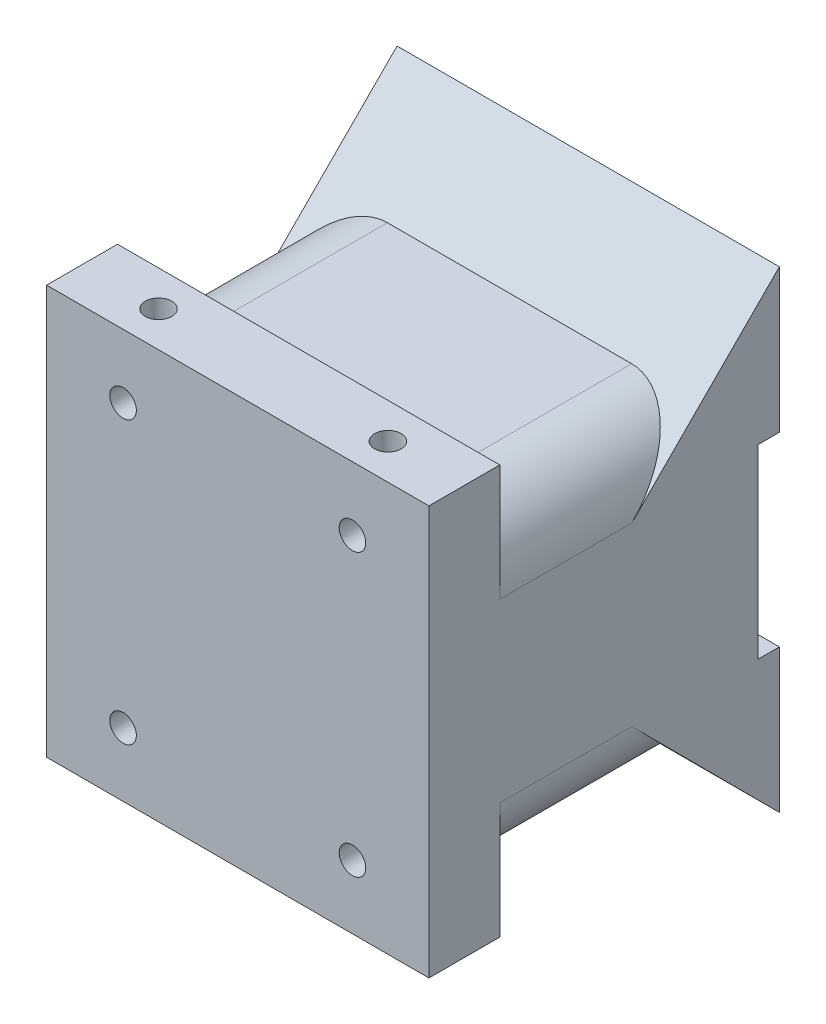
ISO-10303-21;
HEADER;
FILE_DESCRIPTION(('STEP AP214'),'2;1');
FILE_NAME('part.step','',(''),(''),'','','');
FILE_SCHEMA(('AUTOMOTIVE_DESIGN { 1 0 10303 214 1 1 1 1 }'));
ENDSEC;
DATA;
#1=APPLICATION_CONTEXT('core data for automotive mechanical design processes');
#2=APPLICATION_PROTOCOL_DEFINITION('international standard','automotive_design',2000,#1);
#3=PRODUCT_CONTEXT('',#1,'mechanical');
#4=PRODUCT('Part','Part','',(#3));
#5=PRODUCT_RELATED_PRODUCT_CATEGORY('part','',(#4));
#6=PRODUCT_DEFINITION_FORMATION('','',#4);
#7=PRODUCT_DEFINITION_CONTEXT('part definition',#1,'design');
#8=PRODUCT_DEFINITION('design','',#6,#7);
#9=PRODUCT_DEFINITION_SHAPE('','',#8);
#10=(LENGTH_UNIT() NAMED_UNIT(*) SI_UNIT(.MILLI.,.METRE.));
#11=(NAMED_UNIT(*) PLANE_ANGLE_UNIT() SI_UNIT($,.RADIAN.));
#12=(NAMED_UNIT(*) SI_UNIT($,.STERADIAN.) SOLID_ANGLE_UNIT());
#13=UNCERTAINTY_MEASURE_WITH_UNIT(LENGTH_MEASURE(1.E-05),#10,'distance_accuracy_value','');
#14=(GEOMETRIC_REPRESENTATION_CONTEXT(3) GLOBAL_UNCERTAINTY_ASSIGNED_CONTEXT((#13)) GLOBAL_UNIT_ASSIGNED_CONTEXT((#10,
#11,#12)) REPRESENTATION_CONTEXT('',''));
#15=CARTESIAN_POINT('',(0.,0.,0.));
#16=DIRECTION('',(0.,0.,1.));
#17=DIRECTION('',(1.,0.,0.));
#18=AXIS2_PLACEMENT_3D('',#15,#16,#17);
#19=CARTESIAN_POINT('',(72.,-38.5,66.));
#20=DIRECTION('',(0.,1.,0.));
#21=DIRECTION('',(0.,0.,1.));
#22=AXIS2_PLACEMENT_3D('',#19,#20,#21);
#23=PLANE('',#22);
#24=CARTESIAN_POINT('',(14.4,-38.5,59.325));
#25=DIRECTION('',(0.,1.,0.));
#26=DIRECTION('',(0.,0.,1.));
#27=AXIS2_PLACEMENT_3D('',#24,#25,#26);
#28=CIRCLE('',#27,2.5);
#29=CARTESIAN_POINT('',(14.4,-38.5,61.825));
#30=VERTEX_POINT('',#29);
#31=EDGE_CURVE('E349',#30,#30,#28,.T.);
#32=ORIENTED_EDGE('',*,*,#31,.T.);
#33=EDGE_LOOP('',(#32));
#34=FACE_BOUND('',#33,.T.);
#35=DIRECTION('',(0.,0.,-1.));
#36=VECTOR('',#35,1.);
#37=CARTESIAN_POINT('',(0.,-38.5,66.));
#38=LINE('',#37,#36);
#39=CARTESIAN_POINT('',(0.,-38.5,66.));
#40=VERTEX_POINT('',#39);
#41=CARTESIAN_POINT('',(0.,-38.5,52.65));
#42=VERTEX_POINT('',#41);
#43=EDGE_CURVE('E245',#40,#42,#38,.T.);
#44=ORIENTED_EDGE('',*,*,#43,.T.);
#45=DIRECTION('',(-1.,0.,0.));
#46=VECTOR('',#45,1.);
#47=CARTESIAN_POINT('',(72.,-38.5,52.65));
#48=LINE('',#47,#46);
#49=CARTESIAN_POINT('',(72.,-38.5,52.65));
#50=VERTEX_POINT('',#49);
#51=EDGE_CURVE('E258',#50,#42,#48,.T.);
#52=ORIENTED_EDGE('',*,*,#51,.F.);
#53=DIRECTION('',(0.,0.,-1.));
#54=VECTOR('',#53,1.);
#55=CARTESIAN_POINT('',(72.,-38.5,66.));
#56=LINE('',#55,#54);
#57=CARTESIAN_POINT('',(72.,-38.5,66.));
#58=VERTEX_POINT('',#57);
#59=EDGE_CURVE('E299',#58,#50,#56,.T.);
#60=ORIENTED_EDGE('',*,*,#59,.F.);
#61=DIRECTION('',(-1.,0.,0.));
#62=VECTOR('',#61,1.);
#63=CARTESIAN_POINT('',(72.,-38.5,66.));
#64=LINE('',#63,#62);
#65=EDGE_CURVE('E261',#58,#40,#64,.T.);
#66=ORIENTED_EDGE('',*,*,#65,.T.);
#67=EDGE_LOOP('',(#44,#52,#60,#66));
#68=FACE_BOUND('',#67,.T.);
#69=CARTESIAN_POINT('',(57.6,-38.5,59.325));
#70=DIRECTION('',(0.,1.,0.));
#71=DIRECTION('',(0.,0.,1.));
#72=AXIS2_PLACEMENT_3D('',#69,#70,#71);
#73=CIRCLE('',#72,2.5);
#74=CARTESIAN_POINT('',(57.6,-38.5,61.825));
#75=VERTEX_POINT('',#74);
#76=EDGE_CURVE('E355',#75,#75,#73,.T.);
#77=ORIENTED_EDGE('',*,*,#76,.T.);
#78=EDGE_LOOP('',(#77));
#79=FACE_BOUND('',#78,.T.);
#80=ADVANCED_FACE('F30',(#34,#68,#79),#23,.F.);
#81=CARTESIAN_POINT('',(72.,38.5,66.));
#82=DIRECTION('',(0.,0.,-1.));
#83=DIRECTION('',(-1.,0.,0.));
#84=AXIS2_PLACEMENT_3D('',#81,#82,#83);
#85=PLANE('',#84);
#86=CARTESIAN_POINT('',(14.4,-26.5,66.));
#87=DIRECTION('',(0.,0.,-1.));
#88=DIRECTION('',(1.,0.,0.));
#89=AXIS2_PLACEMENT_3D('',#86,#87,#88);
#90=CIRCLE('',#89,2.5);
#91=CARTESIAN_POINT('',(16.9,-26.5,66.));
#92=VERTEX_POINT('',#91);
#93=EDGE_CURVE('E337',#92,#92,#90,.T.);
#94=ORIENTED_EDGE('',*,*,#93,.T.);
#95=EDGE_LOOP('',(#94));
#96=FACE_BOUND('',#95,.T.);
#97=CARTESIAN_POINT('',(57.6,26.5,66.));
#98=DIRECTION('',(0.,0.,1.));
#99=DIRECTION('',(1.,0.,0.));
#100=AXIS2_PLACEMENT_3D('',#97,#98,#99);
#101=CIRCLE('',#100,2.49999999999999);
#102=CARTESIAN_POINT('',(60.1,26.5,66.));
#103=VERTEX_POINT('',#102);
#104=EDGE_CURVE('E319',#103,#103,#101,.T.);
#105=ORIENTED_EDGE('',*,*,#104,.F.);
#106=EDGE_LOOP('',(#105));
#107=FACE_BOUND('',#106,.T.);
#108=CARTESIAN_POINT('',(14.4,26.5,66.));
#109=DIRECTION('',(0.,0.,1.));
#110=DIRECTION('',(1.,0.,0.));
#111=AXIS2_PLACEMENT_3D('',#108,#109,#110);
#112=CIRCLE('',#111,2.5);
#113=CARTESIAN_POINT('',(16.9,26.5,66.));
#114=VERTEX_POINT('',#113);
#115=EDGE_CURVE('E313',#114,#114,#112,.T.);
#116=ORIENTED_EDGE('',*,*,#115,.F.);
#117=EDGE_LOOP('',(#116));
#118=FACE_BOUND('',#117,.T.);
#119=DIRECTION('',(0.,-1.,0.));
#120=VECTOR('',#119,1.);
#121=CARTESIAN_POINT('',(0.,38.5,66.));
#122=LINE('',#121,#120);
#123=CARTESIAN_POINT('',(0.,38.5,66.));
#124=VERTEX_POINT('',#123);
#125=EDGE_CURVE('E238',#124,#40,#122,.T.);
#126=ORIENTED_EDGE('',*,*,#125,.T.);
#127=ORIENTED_EDGE('',*,*,#65,.F.);
#128=DIRECTION('',(0.,-1.,0.));
#129=VECTOR('',#128,1.);
#130=CARTESIAN_POINT('',(72.,38.5,66.));
#131=LINE('',#130,#129);
#132=CARTESIAN_POINT('',(72.,38.5,66.));
#133=VERTEX_POINT('',#132);
#134=EDGE_CURVE('E301',#133,#58,#131,.T.);
#135=ORIENTED_EDGE('',*,*,#134,.F.);
#136=DIRECTION('',(-1.,0.,0.));
#137=VECTOR('',#136,1.);
#138=CARTESIAN_POINT('',(72.,38.5,66.));
#139=LINE('',#138,#137);
#140=EDGE_CURVE('E264',#133,#124,#139,.T.);
#141=ORIENTED_EDGE('',*,*,#140,.T.);
#142=EDGE_LOOP('',(#126,#127,#135,#141));
#143=FACE_BOUND('',#142,.T.);
#144=CARTESIAN_POINT('',(57.6,-26.5,66.));
#145=DIRECTION('',(0.,0.,-1.));
#146=DIRECTION('',(1.,0.,0.));
#147=AXIS2_PLACEMENT_3D('',#144,#145,#146);
#148=CIRCLE('',#147,2.49999999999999);
#149=CARTESIAN_POINT('',(60.1,-26.5,66.));
#150=VERTEX_POINT('',#149);
#151=EDGE_CURVE('E343',#150,#150,#148,.T.);
#152=ORIENTED_EDGE('',*,*,#151,.T.);
#153=EDGE_LOOP('',(#152));
#154=FACE_BOUND('',#153,.T.);
#155=ADVANCED_FACE('F373',(#96,#107,#118,#143,#154),#85,.F.);
#156=CARTESIAN_POINT('',(72.,-17.5,0.));
#157=DIRECTION('',(0.,0.,1.));
#158=DIRECTION('',(0.,-1.,0.));
#159=AXIS2_PLACEMENT_3D('',#156,#157,#158);
#160=PLANE('',#159);
#161=DIRECTION('',(0.,1.,0.));
#162=VECTOR('',#161,1.);
#163=CARTESIAN_POINT('',(0.,-17.5,0.));
#164=LINE('',#163,#162);
#165=CARTESIAN_POINT('',(0.,-44.5,0.));
#166=VERTEX_POINT('',#165);
#167=CARTESIAN_POINT('',(0.,-17.5,0.));
#168=VERTEX_POINT('',#167);
#169=EDGE_CURVE('E178',#166,#168,#164,.T.);
#170=ORIENTED_EDGE('',*,*,#169,.T.);
#171=DIRECTION('',(-1.,0.,0.));
#172=VECTOR('',#171,1.);
#173=CARTESIAN_POINT('',(72.,-17.5,0.));
#174=LINE('',#173,#172);
#175=CARTESIAN_POINT('',(72.,-17.5,0.));
#176=VERTEX_POINT('',#175);
#177=EDGE_CURVE('E158',#176,#168,#174,.T.);
#178=ORIENTED_EDGE('',*,*,#177,.F.);
#179=DIRECTION('',(0.,1.,0.));
#180=VECTOR('',#179,1.);
#181=CARTESIAN_POINT('',(72.,-17.5,0.));
#182=LINE('',#181,#180);
#183=CARTESIAN_POINT('',(72.,-44.5,0.));
#184=VERTEX_POINT('',#183);
#185=EDGE_CURVE('E165',#184,#176,#182,.T.);
#186=ORIENTED_EDGE('',*,*,#185,.F.);
#187=DIRECTION('',(-1.,0.,0.));
#188=VECTOR('',#187,1.);
#189=CARTESIAN_POINT('',(72.,-44.5,0.));
#190=LINE('',#189,#188);
#191=EDGE_CURVE('E250',#184,#166,#190,.T.);
#192=ORIENTED_EDGE('',*,*,#191,.T.);
#193=EDGE_LOOP('',(#170,#178,#186,#192));
#194=FACE_BOUND('',#193,.T.);
#195=ADVANCED_FACE('F176',(#194),#160,.F.);
#196=CARTESIAN_POINT('',(72.,-17.5,4.));
#197=DIRECTION('',(0.,-1.,0.));
#198=DIRECTION('',(0.,0.,-1.));
#199=AXIS2_PLACEMENT_3D('',#196,#197,#198);
#200=PLANE('',#199);
#201=DIRECTION('',(0.,0.,1.));
#202=VECTOR('',#201,1.);
#203=CARTESIAN_POINT('',(0.,-17.5,4.));
#204=LINE('',#203,#202);
#205=CARTESIAN_POINT('',(0.,-17.5,4.));
#206=VERTEX_POINT('',#205);
#207=EDGE_CURVE('E290',#168,#206,#204,.T.);
#208=ORIENTED_EDGE('',*,*,#207,.T.);
#209=DIRECTION('',(-1.,0.,0.));
#210=VECTOR('',#209,1.);
#211=CARTESIAN_POINT('',(72.,-17.5,4.));
#212=LINE('',#211,#210);
#213=CARTESIAN_POINT('',(72.,-17.5,4.));
#214=VERTEX_POINT('',#213);
#215=EDGE_CURVE('E161',#214,#206,#212,.T.);
#216=ORIENTED_EDGE('',*,*,#215,.F.);
#217=DIRECTION('',(0.,0.,1.));
#218=VECTOR('',#217,1.);
#219=CARTESIAN_POINT('',(72.,-17.5,4.));
#220=LINE('',#219,#218);
#221=EDGE_CURVE('E154',#176,#214,#220,.T.);
#222=ORIENTED_EDGE('',*,*,#221,.F.);
#223=ORIENTED_EDGE('',*,*,#177,.T.);
#224=EDGE_LOOP('',(#208,#216,#222,#223));
#225=FACE_BOUND('',#224,.T.);
#226=ADVANCED_FACE('F156',(#225),#200,.F.);
#227=CARTESIAN_POINT('',(72.,17.5,4.));
#228=DIRECTION('',(0.,0.,1.));
#229=DIRECTION('',(1.,0.,0.));
#230=AXIS2_PLACEMENT_3D('',#227,#228,#229);
#231=PLANE('',#230);
#232=DIRECTION('',(0.,1.,0.));
#233=VECTOR('',#232,1.);
#234=CARTESIAN_POINT('',(0.,17.5,4.));
#235=LINE('',#234,#233);
#236=CARTESIAN_POINT('',(0.,17.5,4.));
#237=VERTEX_POINT('',#236);
#238=EDGE_CURVE('E288',#206,#237,#235,.T.);
#239=ORIENTED_EDGE('',*,*,#238,.T.);
#240=DIRECTION('',(-1.,0.,0.));
#241=VECTOR('',#240,1.);
#242=CARTESIAN_POINT('',(72.,17.5,4.));
#243=LINE('',#242,#241);
#244=CARTESIAN_POINT('',(72.,17.5,4.));
#245=VERTEX_POINT('',#244);
#246=EDGE_CURVE('E183',#245,#237,#243,.T.);
#247=ORIENTED_EDGE('',*,*,#246,.F.);
#248=DIRECTION('',(0.,1.,0.));
#249=VECTOR('',#248,1.);
#250=CARTESIAN_POINT('',(72.,17.5,4.));
#251=LINE('',#250,#249);
#252=EDGE_CURVE('E164',#214,#245,#251,.T.);
#253=ORIENTED_EDGE('',*,*,#252,.F.);
#254=ORIENTED_EDGE('',*,*,#215,.T.);
#255=EDGE_LOOP('',(#239,#247,#253,#254));
#256=FACE_BOUND('',#255,.T.);
#257=ADVANCED_FACE('F404',(#256),#231,.F.);
#258=CARTESIAN_POINT('',(72.,17.5,0.));
#259=DIRECTION('',(0.,1.,0.));
#260=DIRECTION('',(0.,0.,1.));
#261=AXIS2_PLACEMENT_3D('',#258,#259,#260);
#262=PLANE('',#261);
#263=DIRECTION('',(0.,0.,-1.));
#264=VECTOR('',#263,1.);
#265=CARTESIAN_POINT('',(0.,17.5,0.));
#266=LINE('',#265,#264);
#267=CARTESIAN_POINT('',(0.,17.5,0.));
#268=VERTEX_POINT('',#267);
#269=EDGE_CURVE('E284',#237,#268,#266,.T.);
#270=ORIENTED_EDGE('',*,*,#269,.T.);
#271=DIRECTION('',(-1.,0.,0.));
#272=VECTOR('',#271,1.);
#273=CARTESIAN_POINT('',(72.,17.5,0.));
#274=LINE('',#273,#272);
#275=CARTESIAN_POINT('',(72.,17.5,0.));
#276=VERTEX_POINT('',#275);
#277=EDGE_CURVE('E275',#276,#268,#274,.T.);
#278=ORIENTED_EDGE('',*,*,#277,.F.);
#279=DIRECTION('',(0.,0.,-1.));
#280=VECTOR('',#279,1.);
#281=CARTESIAN_POINT('',(72.,17.5,0.));
#282=LINE('',#281,#280);
#283=EDGE_CURVE('E285',#245,#276,#282,.T.);
#284=ORIENTED_EDGE('',*,*,#283,.F.);
#285=ORIENTED_EDGE('',*,*,#246,.T.);
#286=EDGE_LOOP('',(#270,#278,#284,#285));
#287=FACE_BOUND('',#286,.T.);
#288=ADVANCED_FACE('F282',(#287),#262,.F.);
#289=CARTESIAN_POINT('',(72.,44.5,0.));
#290=DIRECTION('',(0.,0.,1.));
#291=DIRECTION('',(0.,-1.,0.));
#292=AXIS2_PLACEMENT_3D('',#289,#290,#291);
#293=PLANE('',#292);
#294=DIRECTION('',(0.,1.,0.));
#295=VECTOR('',#294,1.);
#296=CARTESIAN_POINT('',(0.,44.5,0.));
#297=LINE('',#296,#295);
#298=CARTESIAN_POINT('',(0.,44.5,0.));
#299=VERTEX_POINT('',#298);
#300=EDGE_CURVE('E240',#268,#299,#297,.T.);
#301=ORIENTED_EDGE('',*,*,#300,.T.);
#302=DIRECTION('',(-1.,0.,0.));
#303=VECTOR('',#302,1.);
#304=CARTESIAN_POINT('',(72.,44.5,0.));
#305=LINE('',#304,#303);
#306=CARTESIAN_POINT('',(72.,44.5,0.));
#307=VERTEX_POINT('',#306);
#308=EDGE_CURVE('E272',#307,#299,#305,.T.);
#309=ORIENTED_EDGE('',*,*,#308,.F.);
#310=DIRECTION('',(0.,1.,0.));
#311=VECTOR('',#310,1.);
#312=CARTESIAN_POINT('',(72.,44.5,0.));
#313=LINE('',#312,#311);
#314=EDGE_CURVE('E309',#276,#307,#313,.T.);
#315=ORIENTED_EDGE('',*,*,#314,.F.);
#316=ORIENTED_EDGE('',*,*,#277,.T.);
#317=EDGE_LOOP('',(#301,#309,#315,#316));
#318=FACE_BOUND('',#317,.T.);
#319=ADVANCED_FACE('F398',(#318),#293,.F.);
#320=CARTESIAN_POINT('',(72.,29.6,14.8333333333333));
#321=DIRECTION('',(0.,-0.70551956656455,-0.708690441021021));
#322=DIRECTION('',(0.,0.708690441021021,-0.70551956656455));
#323=AXIS2_PLACEMENT_3D('',#320,#321,#322);
#324=PLANE('',#323);
#325=DIRECTION('',(0.,-0.708690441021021,0.70551956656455));
#326=VECTOR('',#325,1.);
#327=CARTESIAN_POINT('',(0.,29.6,14.8333333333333));
#328=LINE('',#327,#326);
#329=CARTESIAN_POINT('',(0.,16.6,27.7751677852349));
#330=VERTEX_POINT('',#329);
#331=EDGE_CURVE('E233',#299,#330,#328,.T.);
#332=ORIENTED_EDGE('',*,*,#331,.T.);
#333=CARTESIAN_POINT('',(13.,16.6,27.7751677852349));
#334=DIRECTION('',(0.,-0.70551956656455,-0.708690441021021));
#335=DIRECTION('',(0.,-0.708690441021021,0.70551956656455));
#336=AXIS2_PLACEMENT_3D('',#333,#334,#335);
#337=ELLIPSE('',#336,18.343693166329,13.);
#338=CARTESIAN_POINT('',(13.,29.6,14.8333333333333));
#339=VERTEX_POINT('',#338);
#340=EDGE_CURVE('E11',#330,#339,#337,.T.);
#341=ORIENTED_EDGE('',*,*,#340,.T.);
#342=DIRECTION('',(-1.,0.,0.));
#343=VECTOR('',#342,1.);
#344=CARTESIAN_POINT('',(72.,29.6,14.8333333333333));
#345=LINE('',#344,#343);
#346=CARTESIAN_POINT('',(58.9999999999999,29.6,14.8333333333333));
#347=VERTEX_POINT('',#346);
#348=EDGE_CURVE('E270',#347,#339,#345,.T.);
#349=ORIENTED_EDGE('',*,*,#348,.F.);
#350=CARTESIAN_POINT('',(58.9999999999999,16.6,27.7751677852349));
#351=DIRECTION('',(0.,-0.70551956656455,-0.708690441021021));
#352=DIRECTION('',(0.,0.708690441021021,-0.70551956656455));
#353=AXIS2_PLACEMENT_3D('',#350,#351,#352);
#354=ELLIPSE('',#353,18.343693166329,13.);
#355=CARTESIAN_POINT('',(72.,16.6,27.7751677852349));
#356=VERTEX_POINT('',#355);
#357=EDGE_CURVE('E216',#347,#356,#354,.T.);
#358=ORIENTED_EDGE('',*,*,#357,.T.);
#359=DIRECTION('',(0.,-0.708690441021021,0.70551956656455));
#360=VECTOR('',#359,1.);
#361=CARTESIAN_POINT('',(72.,29.6,14.8333333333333));
#362=LINE('',#361,#360);
#363=EDGE_CURVE('E307',#307,#356,#362,.T.);
#364=ORIENTED_EDGE('',*,*,#363,.F.);
#365=ORIENTED_EDGE('',*,*,#308,.T.);
#366=EDGE_LOOP('',(#332,#341,#349,#358,#364,#365));
#367=FACE_BOUND('',#366,.T.);
#368=ADVANCED_FACE('F395',(#367),#324,.F.);
#369=CARTESIAN_POINT('',(72.,29.6,14.8333333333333));
#370=DIRECTION('',(0.,-1.,0.));
#371=DIRECTION('',(0.,0.,-1.));
#372=AXIS2_PLACEMENT_3D('',#369,#370,#371);
#373=PLANE('',#372);
#374=DIRECTION('',(-1.,0.,0.));
#375=VECTOR('',#374,1.);
#376=CARTESIAN_POINT('',(72.,29.6,52.65));
#377=LINE('',#376,#375);
#378=CARTESIAN_POINT('',(58.9999999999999,29.6,52.65));
#379=VERTEX_POINT('',#378);
#380=CARTESIAN_POINT('',(13.,29.6,52.65));
#381=VERTEX_POINT('',#380);
#382=EDGE_CURVE('E226',#379,#381,#377,.T.);
#383=ORIENTED_EDGE('',*,*,#382,.F.);
#384=DIRECTION('',(0.,0.,1.));
#385=VECTOR('',#384,1.);
#386=CARTESIAN_POINT('',(58.9999999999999,29.6,14.8333333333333));
#387=LINE('',#386,#385);
#388=EDGE_CURVE('E50',#379,#347,#387,.F.);
#389=ORIENTED_EDGE('',*,*,#388,.T.);
#390=ORIENTED_EDGE('',*,*,#348,.T.);
#391=DIRECTION('',(0.,0.,1.));
#392=VECTOR('',#391,1.);
#393=CARTESIAN_POINT('',(13.,29.6,14.8333333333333));
#394=LINE('',#393,#392);
#395=EDGE_CURVE('E200',#339,#381,#394,.T.);
#396=ORIENTED_EDGE('',*,*,#395,.T.);
#397=EDGE_LOOP('',(#383,#389,#390,#396));
#398=FACE_BOUND('',#397,.T.);
#399=ADVANCED_FACE('F392',(#398),#373,.F.);
#400=CARTESIAN_POINT('',(72.,29.6,52.65));
#401=DIRECTION('',(0.,0.,1.));
#402=DIRECTION('',(0.,-1.,0.));
#403=AXIS2_PLACEMENT_3D('',#400,#401,#402);
#404=PLANE('',#403);
#405=DIRECTION('',(0.,1.,0.));
#406=VECTOR('',#405,1.);
#407=CARTESIAN_POINT('',(0.,29.6,52.65));
#408=LINE('',#407,#406);
#409=CARTESIAN_POINT('',(0.,16.6,52.65));
#410=VERTEX_POINT('',#409);
#411=CARTESIAN_POINT('',(0.,38.5,52.65));
#412=VERTEX_POINT('',#411);
#413=EDGE_CURVE('E224',#410,#412,#408,.T.);
#414=ORIENTED_EDGE('',*,*,#413,.T.);
#415=DIRECTION('',(-1.,0.,0.));
#416=VECTOR('',#415,1.);
#417=CARTESIAN_POINT('',(72.,38.5,52.65));
#418=LINE('',#417,#416);
#419=CARTESIAN_POINT('',(72.,38.5,52.65));
#420=VERTEX_POINT('',#419);
#421=EDGE_CURVE('E267',#420,#412,#418,.T.);
#422=ORIENTED_EDGE('',*,*,#421,.F.);
#423=DIRECTION('',(0.,1.,0.));
#424=VECTOR('',#423,1.);
#425=CARTESIAN_POINT('',(72.,29.6,52.65));
#426=LINE('',#425,#424);
#427=CARTESIAN_POINT('',(72.,16.6,52.65));
#428=VERTEX_POINT('',#427);
#429=EDGE_CURVE('E305',#428,#420,#426,.T.);
#430=ORIENTED_EDGE('',*,*,#429,.F.);
#431=CARTESIAN_POINT('',(58.9999999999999,16.6,52.65));
#432=DIRECTION('',(0.,0.,1.));
#433=DIRECTION('',(0.,-1.,0.));
#434=AXIS2_PLACEMENT_3D('',#431,#432,#433);
#435=CIRCLE('',#434,13.);
#436=EDGE_CURVE('E214',#428,#379,#435,.T.);
#437=ORIENTED_EDGE('',*,*,#436,.T.);
#438=ORIENTED_EDGE('',*,*,#382,.T.);
#439=CARTESIAN_POINT('',(13.,16.6,52.65));
#440=DIRECTION('',(0.,0.,1.));
#441=DIRECTION('',(0.,-1.,0.));
#442=AXIS2_PLACEMENT_3D('',#439,#440,#441);
#443=CIRCLE('',#442,13.);
#444=EDGE_CURVE('E38',#381,#410,#443,.T.);
#445=ORIENTED_EDGE('',*,*,#444,.T.);
#446=EDGE_LOOP('',(#414,#422,#430,#437,#438,#445));
#447=FACE_BOUND('',#446,.T.);
#448=ADVANCED_FACE('F222',(#447),#404,.F.);
#449=CARTESIAN_POINT('',(72.,38.5,52.65));
#450=DIRECTION('',(0.,-1.,0.));
#451=DIRECTION('',(0.,0.,-1.));
#452=AXIS2_PLACEMENT_3D('',#449,#450,#451);
#453=PLANE('',#452);
#454=CARTESIAN_POINT('',(57.6,38.5,59.325));
#455=DIRECTION('',(0.,1.,0.));
#456=DIRECTION('',(0.,0.,1.));
#457=AXIS2_PLACEMENT_3D('',#454,#455,#456);
#458=CIRCLE('',#457,2.5);
#459=CARTESIAN_POINT('',(57.6,38.5,61.825));
#460=VERTEX_POINT('',#459);
#461=EDGE_CURVE('E331',#460,#460,#458,.T.);
#462=ORIENTED_EDGE('',*,*,#461,.F.);
#463=EDGE_LOOP('',(#462));
#464=FACE_BOUND('',#463,.T.);
#465=CARTESIAN_POINT('',(14.4,38.5,59.325));
#466=DIRECTION('',(0.,1.,0.));
#467=DIRECTION('',(0.,0.,1.));
#468=AXIS2_PLACEMENT_3D('',#465,#466,#467);
#469=CIRCLE('',#468,2.5);
#470=CARTESIAN_POINT('',(14.4,38.5,61.825));
#471=VERTEX_POINT('',#470);
#472=EDGE_CURVE('E325',#471,#471,#469,.T.);
#473=ORIENTED_EDGE('',*,*,#472,.F.);
#474=EDGE_LOOP('',(#473));
#475=FACE_BOUND('',#474,.T.);
#476=DIRECTION('',(0.,0.,1.));
#477=VECTOR('',#476,1.);
#478=CARTESIAN_POINT('',(0.,38.5,52.65));
#479=LINE('',#478,#477);
#480=EDGE_CURVE('E236',#412,#124,#479,.T.);
#481=ORIENTED_EDGE('',*,*,#480,.T.);
#482=ORIENTED_EDGE('',*,*,#140,.F.);
#483=DIRECTION('',(0.,0.,1.));
#484=VECTOR('',#483,1.);
#485=CARTESIAN_POINT('',(72.,38.5,52.65));
#486=LINE('',#485,#484);
#487=EDGE_CURVE('E303',#420,#133,#486,.T.);
#488=ORIENTED_EDGE('',*,*,#487,.F.);
#489=ORIENTED_EDGE('',*,*,#421,.T.);
#490=EDGE_LOOP('',(#481,#482,#488,#489));
#491=FACE_BOUND('',#490,.T.);
#492=ADVANCED_FACE('F386',(#464,#475,#491),#453,.F.);
#493=CARTESIAN_POINT('',(72.,-38.5,52.65));
#494=DIRECTION('',(0.,0.,1.));
#495=DIRECTION('',(0.,-1.,0.));
#496=AXIS2_PLACEMENT_3D('',#493,#494,#495);
#497=PLANE('',#496);
#498=DIRECTION('',(0.,1.,0.));
#499=VECTOR('',#498,1.);
#500=CARTESIAN_POINT('',(0.,-38.5,52.65));
#501=LINE('',#500,#499);
#502=CARTESIAN_POINT('',(0.,-16.6,52.65));
#503=VERTEX_POINT('',#502);
#504=EDGE_CURVE('E247',#42,#503,#501,.T.);
#505=ORIENTED_EDGE('',*,*,#504,.T.);
#506=CARTESIAN_POINT('',(13.,-16.6,52.65));
#507=DIRECTION('',(0.,0.,1.));
#508=DIRECTION('',(0.,-1.,0.));
#509=AXIS2_PLACEMENT_3D('',#506,#507,#508);
#510=CIRCLE('',#509,13.);
#511=CARTESIAN_POINT('',(13.,-29.6,52.65));
#512=VERTEX_POINT('',#511);
#513=EDGE_CURVE('E207',#503,#512,#510,.T.);
#514=ORIENTED_EDGE('',*,*,#513,.T.);
#515=DIRECTION('',(-1.,0.,0.));
#516=VECTOR('',#515,1.);
#517=CARTESIAN_POINT('',(72.,-29.6,52.65));
#518=LINE('',#517,#516);
#519=CARTESIAN_POINT('',(58.9999999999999,-29.6,52.65));
#520=VERTEX_POINT('',#519);
#521=EDGE_CURVE('E255',#520,#512,#518,.T.);
#522=ORIENTED_EDGE('',*,*,#521,.F.);
#523=CARTESIAN_POINT('',(58.9999999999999,-16.6,52.65));
#524=DIRECTION('',(0.,0.,1.));
#525=DIRECTION('',(0.,-1.,0.));
#526=AXIS2_PLACEMENT_3D('',#523,#524,#525);
#527=CIRCLE('',#526,13.);
#528=CARTESIAN_POINT('',(72.,-16.6,52.65));
#529=VERTEX_POINT('',#528);
#530=EDGE_CURVE('E211',#520,#529,#527,.T.);
#531=ORIENTED_EDGE('',*,*,#530,.T.);
#532=DIRECTION('',(0.,1.,0.));
#533=VECTOR('',#532,1.);
#534=CARTESIAN_POINT('',(72.,-38.5,52.65));
#535=LINE('',#534,#533);
#536=EDGE_CURVE('E297',#50,#529,#535,.T.);
#537=ORIENTED_EDGE('',*,*,#536,.F.);
#538=ORIENTED_EDGE('',*,*,#51,.T.);
#539=EDGE_LOOP('',(#505,#514,#522,#531,#537,#538));
#540=FACE_BOUND('',#539,.T.);
#541=ADVANCED_FACE('F383',(#540),#497,.F.);
#542=CARTESIAN_POINT('',(72.,-29.6,52.65));
#543=DIRECTION('',(0.,1.,0.));
#544=DIRECTION('',(0.,0.,1.));
#545=AXIS2_PLACEMENT_3D('',#542,#543,#544);
#546=PLANE('',#545);
#547=ORIENTED_EDGE('',*,*,#521,.T.);
#548=DIRECTION('',(0.,0.,-1.));
#549=VECTOR('',#548,1.);
#550=CARTESIAN_POINT('',(13.,-29.6,52.65));
#551=LINE('',#550,#549);
#552=CARTESIAN_POINT('',(13.,-29.6,14.8333333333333));
#553=VERTEX_POINT('',#552);
#554=EDGE_CURVE('E181',#512,#553,#551,.T.);
#555=ORIENTED_EDGE('',*,*,#554,.T.);
#556=DIRECTION('',(-1.,0.,0.));
#557=VECTOR('',#556,1.);
#558=CARTESIAN_POINT('',(72.,-29.6,14.8333333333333));
#559=LINE('',#558,#557);
#560=CARTESIAN_POINT('',(58.9999999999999,-29.6,14.8333333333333));
#561=VERTEX_POINT('',#560);
#562=EDGE_CURVE('E252',#561,#553,#559,.T.);
#563=ORIENTED_EDGE('',*,*,#562,.F.);
#564=DIRECTION('',(0.,0.,-1.));
#565=VECTOR('',#564,1.);
#566=CARTESIAN_POINT('',(58.9999999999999,-29.6,52.65));
#567=LINE('',#566,#565);
#568=EDGE_CURVE('E179',#561,#520,#567,.F.);
#569=ORIENTED_EDGE('',*,*,#568,.T.);
#570=EDGE_LOOP('',(#547,#555,#563,#569));
#571=FACE_BOUND('',#570,.T.);
#572=ADVANCED_FACE('F454',(#571),#546,.F.);
#573=CARTESIAN_POINT('',(72.,-29.6,14.8333333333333));
#574=DIRECTION('',(0.,0.70551956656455,-0.708690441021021));
#575=DIRECTION('',(0.,0.708690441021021,0.70551956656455));
#576=AXIS2_PLACEMENT_3D('',#573,#574,#575);
#577=PLANE('',#576);
#578=DIRECTION('',(0.,-0.708690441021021,-0.70551956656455));
#579=VECTOR('',#578,1.);
#580=CARTESIAN_POINT('',(0.,-29.6,14.8333333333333));
#581=LINE('',#580,#579);
#582=CARTESIAN_POINT('',(0.,-16.6,27.7751677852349));
#583=VERTEX_POINT('',#582);
#584=EDGE_CURVE('E174',#583,#166,#581,.T.);
#585=ORIENTED_EDGE('',*,*,#584,.T.);
#586=ORIENTED_EDGE('',*,*,#191,.F.);
#587=DIRECTION('',(0.,-0.708690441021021,-0.70551956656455));
#588=VECTOR('',#587,1.);
#589=CARTESIAN_POINT('',(72.,-29.6,14.8333333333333));
#590=LINE('',#589,#588);
#591=CARTESIAN_POINT('',(72.,-16.6,27.7751677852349));
#592=VERTEX_POINT('',#591);
#593=EDGE_CURVE('E170',#592,#184,#590,.T.);
#594=ORIENTED_EDGE('',*,*,#593,.F.);
#595=CARTESIAN_POINT('',(58.9999999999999,-16.6,27.7751677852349));
#596=DIRECTION('',(0.,0.70551956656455,-0.708690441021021));
#597=DIRECTION('',(0.,0.708690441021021,0.70551956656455));
#598=AXIS2_PLACEMENT_3D('',#595,#596,#597);
#599=ELLIPSE('',#598,18.343693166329,13.);
#600=EDGE_CURVE('E209',#592,#561,#599,.T.);
#601=ORIENTED_EDGE('',*,*,#600,.T.);
#602=ORIENTED_EDGE('',*,*,#562,.T.);
#603=CARTESIAN_POINT('',(13.,-16.6,27.7751677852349));
#604=DIRECTION('',(0.,0.70551956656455,-0.708690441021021));
#605=DIRECTION('',(0.,-0.708690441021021,-0.70551956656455));
#606=AXIS2_PLACEMENT_3D('',#603,#604,#605);
#607=ELLIPSE('',#606,18.343693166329,13.);
#608=EDGE_CURVE('E204',#553,#583,#607,.T.);
#609=ORIENTED_EDGE('',*,*,#608,.T.);
#610=EDGE_LOOP('',(#585,#586,#594,#601,#602,#609));
#611=FACE_BOUND('',#610,.T.);
#612=ADVANCED_FACE('F452',(#611),#577,.F.);
#613=CARTESIAN_POINT('',(72.,-29.6,0.));
#614=DIRECTION('',(1.,0.,0.));
#615=DIRECTION('',(0.,0.,-1.));
#616=AXIS2_PLACEMENT_3D('',#613,#614,#615);
#617=PLANE('',#616);
#618=DIRECTION('',(0.,0.,-1.));
#619=VECTOR('',#618,1.);
#620=CARTESIAN_POINT('',(72.,-16.6,14.8333333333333));
#621=LINE('',#620,#619);
#622=EDGE_CURVE('E198',#529,#592,#621,.T.);
#623=ORIENTED_EDGE('',*,*,#622,.T.);
#624=ORIENTED_EDGE('',*,*,#593,.T.);
#625=ORIENTED_EDGE('',*,*,#185,.T.);
#626=ORIENTED_EDGE('',*,*,#221,.T.);
#627=ORIENTED_EDGE('',*,*,#252,.T.);
#628=ORIENTED_EDGE('',*,*,#283,.T.);
#629=ORIENTED_EDGE('',*,*,#314,.T.);
#630=ORIENTED_EDGE('',*,*,#363,.T.);
#631=DIRECTION('',(0.,0.,1.));
#632=VECTOR('',#631,1.);
#633=CARTESIAN_POINT('',(72.,16.6,52.65));
#634=LINE('',#633,#632);
#635=EDGE_CURVE('E195',#356,#428,#634,.T.);
#636=ORIENTED_EDGE('',*,*,#635,.T.);
#637=ORIENTED_EDGE('',*,*,#429,.T.);
#638=ORIENTED_EDGE('',*,*,#487,.T.);
#639=ORIENTED_EDGE('',*,*,#134,.T.);
#640=ORIENTED_EDGE('',*,*,#59,.T.);
#641=ORIENTED_EDGE('',*,*,#536,.T.);
#642=EDGE_LOOP('',(#623,#624,#625,#626,#627,#628,#629,#630,#636,#637,#638,#639,#640,#641));
#643=FACE_BOUND('',#642,.T.);
#644=ADVANCED_FACE('F169',(#643),#617,.T.);
#645=CARTESIAN_POINT('',(0.,-29.6,0.));
#646=DIRECTION('',(1.,0.,0.));
#647=DIRECTION('',(0.,0.,-1.));
#648=AXIS2_PLACEMENT_3D('',#645,#646,#647);
#649=PLANE('',#648);
#650=ORIENTED_EDGE('',*,*,#584,.F.);
#651=DIRECTION('',(0.,0.,-1.));
#652=VECTOR('',#651,1.);
#653=CARTESIAN_POINT('',(0.,-16.6,0.));
#654=LINE('',#653,#652);
#655=EDGE_CURVE('E192',#583,#503,#654,.F.);
#656=ORIENTED_EDGE('',*,*,#655,.T.);
#657=ORIENTED_EDGE('',*,*,#504,.F.);
#658=ORIENTED_EDGE('',*,*,#43,.F.);
#659=ORIENTED_EDGE('',*,*,#125,.F.);
#660=ORIENTED_EDGE('',*,*,#480,.F.);
#661=ORIENTED_EDGE('',*,*,#413,.F.);
#662=DIRECTION('',(0.,0.,1.));
#663=VECTOR('',#662,1.);
#664=CARTESIAN_POINT('',(0.,16.6,0.));
#665=LINE('',#664,#663);
#666=EDGE_CURVE('E189',#410,#330,#665,.F.);
#667=ORIENTED_EDGE('',*,*,#666,.T.);
#668=ORIENTED_EDGE('',*,*,#331,.F.);
#669=ORIENTED_EDGE('',*,*,#300,.F.);
#670=ORIENTED_EDGE('',*,*,#269,.F.);
#671=ORIENTED_EDGE('',*,*,#238,.F.);
#672=ORIENTED_EDGE('',*,*,#207,.F.);
#673=ORIENTED_EDGE('',*,*,#169,.F.);
#674=EDGE_LOOP('',(#650,#656,#657,#658,#659,#660,#661,#667,#668,#669,#670,#671,#672,#673));
#675=FACE_BOUND('',#674,.T.);
#676=ADVANCED_FACE('F231',(#675),#649,.F.);
#677=CARTESIAN_POINT('',(13.,-16.6,52.65));
#678=DIRECTION('',(0.,0.,-1.));
#679=DIRECTION('',(0.,1.,0.));
#680=AXIS2_PLACEMENT_3D('',#677,#678,#679);
#681=CYLINDRICAL_SURFACE('',#680,13.);
#682=ORIENTED_EDGE('',*,*,#513,.F.);
#683=ORIENTED_EDGE('',*,*,#655,.F.);
#684=ORIENTED_EDGE('',*,*,#608,.F.);
#685=ORIENTED_EDGE('',*,*,#554,.F.);
#686=EDGE_LOOP('',(#682,#683,#684,#685));
#687=FACE_BOUND('',#686,.T.);
#688=ADVANCED_FACE('F411',(#687),#681,.T.);
#689=CARTESIAN_POINT('',(58.9999999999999,-16.6,0.));
#690=DIRECTION('',(0.,0.,1.));
#691=DIRECTION('',(0.,-1.,0.));
#692=AXIS2_PLACEMENT_3D('',#689,#690,#691);
#693=CYLINDRICAL_SURFACE('',#692,13.);
#694=ORIENTED_EDGE('',*,*,#530,.F.);
#695=ORIENTED_EDGE('',*,*,#568,.F.);
#696=ORIENTED_EDGE('',*,*,#600,.F.);
#697=ORIENTED_EDGE('',*,*,#622,.F.);
#698=EDGE_LOOP('',(#694,#695,#696,#697));
#699=FACE_BOUND('',#698,.T.);
#700=ADVANCED_FACE('F414',(#699),#693,.T.);
#701=CARTESIAN_POINT('',(58.9999999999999,16.6,0.));
#702=DIRECTION('',(0.,0.,-1.));
#703=DIRECTION('',(0.,1.,0.));
#704=AXIS2_PLACEMENT_3D('',#701,#702,#703);
#705=CYLINDRICAL_SURFACE('',#704,13.);
#706=ORIENTED_EDGE('',*,*,#357,.F.);
#707=ORIENTED_EDGE('',*,*,#388,.F.);
#708=ORIENTED_EDGE('',*,*,#436,.F.);
#709=ORIENTED_EDGE('',*,*,#635,.F.);
#710=EDGE_LOOP('',(#706,#707,#708,#709));
#711=FACE_BOUND('',#710,.T.);
#712=ADVANCED_FACE('F417',(#711),#705,.T.);
#713=CARTESIAN_POINT('',(13.,16.6,14.8333333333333));
#714=DIRECTION('',(0.,0.,1.));
#715=DIRECTION('',(0.,-1.,0.));
#716=AXIS2_PLACEMENT_3D('',#713,#714,#715);
#717=CYLINDRICAL_SURFACE('',#716,13.);
#718=ORIENTED_EDGE('',*,*,#340,.F.);
#719=ORIENTED_EDGE('',*,*,#666,.F.);
#720=ORIENTED_EDGE('',*,*,#444,.F.);
#721=ORIENTED_EDGE('',*,*,#395,.F.);
#722=EDGE_LOOP('',(#718,#719,#720,#721));
#723=FACE_BOUND('',#722,.T.);
#724=ADVANCED_FACE('F32',(#723),#717,.T.);
#725=CARTESIAN_POINT('',(14.4,26.5,61.));
#726=DIRECTION('',(0.,0.,1.));
#727=DIRECTION('',(1.,0.,0.));
#728=AXIS2_PLACEMENT_3D('',#725,#726,#727);
#729=CYLINDRICAL_SURFACE('',#728,2.5);
#730=CARTESIAN_POINT('',(14.4,26.5,61.));
#731=DIRECTION('',(0.,0.,1.));
#732=DIRECTION('',(1.,0.,0.));
#733=AXIS2_PLACEMENT_3D('',#730,#731,#732);
#734=CIRCLE('',#733,2.5);
#735=CARTESIAN_POINT('',(16.9,26.5,61.));
#736=VERTEX_POINT('',#735);
#737=EDGE_CURVE('E295',#736,#736,#734,.T.);
#738=ORIENTED_EDGE('',*,*,#737,.F.);
#739=EDGE_LOOP('',(#738));
#740=FACE_BOUND('',#739,.T.);
#741=ORIENTED_EDGE('',*,*,#115,.T.);
#742=EDGE_LOOP('',(#741));
#743=FACE_BOUND('',#742,.T.);
#744=ADVANCED_FACE('F424',(#740,#743),#729,.F.);
#745=CARTESIAN_POINT('',(14.4,26.5,61.));
#746=DIRECTION('',(0.,0.,1.));
#747=DIRECTION('',(1.,0.,0.));
#748=AXIS2_PLACEMENT_3D('',#745,#746,#747);
#749=PLANE('',#748);
#750=ORIENTED_EDGE('',*,*,#737,.T.);
#751=EDGE_LOOP('',(#750));
#752=FACE_BOUND('',#751,.T.);
#753=ADVANCED_FACE('F471',(#752),#749,.T.);
#754=CARTESIAN_POINT('',(57.6,26.5,61.));
#755=DIRECTION('',(0.,0.,1.));
#756=DIRECTION('',(1.,0.,0.));
#757=AXIS2_PLACEMENT_3D('',#754,#755,#756);
#758=CYLINDRICAL_SURFACE('',#757,2.49999999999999);
#759=CARTESIAN_POINT('',(57.6,26.5,61.));
#760=DIRECTION('',(0.,0.,1.));
#761=DIRECTION('',(1.,0.,0.));
#762=AXIS2_PLACEMENT_3D('',#759,#760,#761);
#763=CIRCLE('',#762,2.49999999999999);
#764=CARTESIAN_POINT('',(60.1,26.5,61.));
#765=VERTEX_POINT('',#764);
#766=EDGE_CURVE('E316',#765,#765,#763,.T.);
#767=ORIENTED_EDGE('',*,*,#766,.F.);
#768=EDGE_LOOP('',(#767));
#769=FACE_BOUND('',#768,.T.);
#770=ORIENTED_EDGE('',*,*,#104,.T.);
#771=EDGE_LOOP('',(#770));
#772=FACE_BOUND('',#771,.T.);
#773=ADVANCED_FACE('F475',(#769,#772),#758,.F.);
#774=CARTESIAN_POINT('',(57.6,26.5,61.));
#775=DIRECTION('',(0.,0.,1.));
#776=DIRECTION('',(1.,0.,0.));
#777=AXIS2_PLACEMENT_3D('',#774,#775,#776);
#778=PLANE('',#777);
#779=ORIENTED_EDGE('',*,*,#766,.T.);
#780=EDGE_LOOP('',(#779));
#781=FACE_BOUND('',#780,.T.);
#782=ADVANCED_FACE('F479',(#781),#778,.T.);
#783=CARTESIAN_POINT('',(14.4,33.5,59.325));
#784=DIRECTION('',(0.,1.,0.));
#785=DIRECTION('',(0.,0.,1.));
#786=AXIS2_PLACEMENT_3D('',#783,#784,#785);
#787=CYLINDRICAL_SURFACE('',#786,2.5);
#788=CARTESIAN_POINT('',(14.4,33.5,59.325));
#789=DIRECTION('',(0.,1.,0.));
#790=DIRECTION('',(0.,0.,1.));
#791=AXIS2_PLACEMENT_3D('',#788,#789,#790);
#792=CIRCLE('',#791,2.5);
#793=CARTESIAN_POINT('',(14.4,33.5,61.825));
#794=VERTEX_POINT('',#793);
#795=EDGE_CURVE('E322',#794,#794,#792,.T.);
#796=ORIENTED_EDGE('',*,*,#795,.F.);
#797=EDGE_LOOP('',(#796));
#798=FACE_BOUND('',#797,.T.);
#799=ORIENTED_EDGE('',*,*,#472,.T.);
#800=EDGE_LOOP('',(#799));
#801=FACE_BOUND('',#800,.T.);
#802=ADVANCED_FACE('F483',(#798,#801),#787,.F.);
#803=CARTESIAN_POINT('',(14.4,33.5,59.325));
#804=DIRECTION('',(0.,1.,0.));
#805=DIRECTION('',(0.,0.,1.));
#806=AXIS2_PLACEMENT_3D('',#803,#804,#805);
#807=PLANE('',#806);
#808=ORIENTED_EDGE('',*,*,#795,.T.);
#809=EDGE_LOOP('',(#808));
#810=FACE_BOUND('',#809,.T.);
#811=ADVANCED_FACE('F487',(#810),#807,.T.);
#812=CARTESIAN_POINT('',(57.6,33.5,59.325));
#813=DIRECTION('',(0.,1.,0.));
#814=DIRECTION('',(0.,0.,1.));
#815=AXIS2_PLACEMENT_3D('',#812,#813,#814);
#816=CYLINDRICAL_SURFACE('',#815,2.5);
#817=CARTESIAN_POINT('',(57.6,33.5,59.325));
#818=DIRECTION('',(0.,1.,0.));
#819=DIRECTION('',(0.,0.,1.));
#820=AXIS2_PLACEMENT_3D('',#817,#818,#819);
#821=CIRCLE('',#820,2.5);
#822=CARTESIAN_POINT('',(57.6,33.5,61.825));
#823=VERTEX_POINT('',#822);
#824=EDGE_CURVE('E328',#823,#823,#821,.T.);
#825=ORIENTED_EDGE('',*,*,#824,.F.);
#826=EDGE_LOOP('',(#825));
#827=FACE_BOUND('',#826,.T.);
#828=ORIENTED_EDGE('',*,*,#461,.T.);
#829=EDGE_LOOP('',(#828));
#830=FACE_BOUND('',#829,.T.);
#831=ADVANCED_FACE('F491',(#827,#830),#816,.F.);
#832=CARTESIAN_POINT('',(57.6,33.5,59.325));
#833=DIRECTION('',(0.,1.,0.));
#834=DIRECTION('',(0.,0.,1.));
#835=AXIS2_PLACEMENT_3D('',#832,#833,#834);
#836=PLANE('',#835);
#837=ORIENTED_EDGE('',*,*,#824,.T.);
#838=EDGE_LOOP('',(#837));
#839=FACE_BOUND('',#838,.T.);
#840=ADVANCED_FACE('F495',(#839),#836,.T.);
#841=CARTESIAN_POINT('',(14.4,-26.5,61.));
#842=DIRECTION('',(0.,0.,1.));
#843=DIRECTION('',(1.,0.,0.));
#844=AXIS2_PLACEMENT_3D('',#841,#842,#843);
#845=CYLINDRICAL_SURFACE('',#844,2.5);
#846=CARTESIAN_POINT('',(14.4,-26.5,61.));
#847=DIRECTION('',(0.,0.,-1.));
#848=DIRECTION('',(1.,0.,0.));
#849=AXIS2_PLACEMENT_3D('',#846,#847,#848);
#850=CIRCLE('',#849,2.5);
#851=CARTESIAN_POINT('',(16.9,-26.5,61.));
#852=VERTEX_POINT('',#851);
#853=EDGE_CURVE('E334',#852,#852,#850,.T.);
#854=ORIENTED_EDGE('',*,*,#853,.T.);
#855=EDGE_LOOP('',(#854));
#856=FACE_BOUND('',#855,.T.);
#857=ORIENTED_EDGE('',*,*,#93,.F.);
#858=EDGE_LOOP('',(#857));
#859=FACE_BOUND('',#858,.T.);
#860=ADVANCED_FACE('F499',(#856,#859),#845,.F.);
#861=CARTESIAN_POINT('',(14.4,-26.5,61.));
#862=DIRECTION('',(0.,0.,1.));
#863=DIRECTION('',(1.,0.,0.));
#864=AXIS2_PLACEMENT_3D('',#861,#862,#863);
#865=PLANE('',#864);
#866=ORIENTED_EDGE('',*,*,#853,.F.);
#867=EDGE_LOOP('',(#866));
#868=FACE_BOUND('',#867,.T.);
#869=ADVANCED_FACE('F503',(#868),#865,.T.);
#870=CARTESIAN_POINT('',(57.6,-26.5,61.));
#871=DIRECTION('',(0.,0.,1.));
#872=DIRECTION('',(1.,0.,0.));
#873=AXIS2_PLACEMENT_3D('',#870,#871,#872);
#874=CYLINDRICAL_SURFACE('',#873,2.49999999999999);
#875=CARTESIAN_POINT('',(57.6,-26.5,61.));
#876=DIRECTION('',(0.,0.,-1.));
#877=DIRECTION('',(1.,0.,0.));
#878=AXIS2_PLACEMENT_3D('',#875,#876,#877);
#879=CIRCLE('',#878,2.49999999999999);
#880=CARTESIAN_POINT('',(60.1,-26.5,61.));
#881=VERTEX_POINT('',#880);
#882=EDGE_CURVE('E340',#881,#881,#879,.T.);
#883=ORIENTED_EDGE('',*,*,#882,.T.);
#884=EDGE_LOOP('',(#883));
#885=FACE_BOUND('',#884,.T.);
#886=ORIENTED_EDGE('',*,*,#151,.F.);
#887=EDGE_LOOP('',(#886));
#888=FACE_BOUND('',#887,.T.);
#889=ADVANCED_FACE('F507',(#885,#888),#874,.F.);
#890=CARTESIAN_POINT('',(57.6,-26.5,61.));
#891=DIRECTION('',(0.,0.,1.));
#892=DIRECTION('',(1.,0.,0.));
#893=AXIS2_PLACEMENT_3D('',#890,#891,#892);
#894=PLANE('',#893);
#895=ORIENTED_EDGE('',*,*,#882,.F.);
#896=EDGE_LOOP('',(#895));
#897=FACE_BOUND('',#896,.T.);
#898=ADVANCED_FACE('F511',(#897),#894,.T.);
#899=CARTESIAN_POINT('',(14.4,-33.5,59.325));
#900=DIRECTION('',(0.,-1.,0.));
#901=DIRECTION('',(0.,0.,-1.));
#902=AXIS2_PLACEMENT_3D('',#899,#900,#901);
#903=CYLINDRICAL_SURFACE('',#902,2.5);
#904=CARTESIAN_POINT('',(14.4,-33.5,59.325));
#905=DIRECTION('',(0.,1.,0.));
#906=DIRECTION('',(0.,0.,1.));
#907=AXIS2_PLACEMENT_3D('',#904,#905,#906);
#908=CIRCLE('',#907,2.5);
#909=CARTESIAN_POINT('',(14.4,-33.5,61.825));
#910=VERTEX_POINT('',#909);
#911=EDGE_CURVE('E346',#910,#910,#908,.T.);
#912=ORIENTED_EDGE('',*,*,#911,.T.);
#913=EDGE_LOOP('',(#912));
#914=FACE_BOUND('',#913,.T.);
#915=ORIENTED_EDGE('',*,*,#31,.F.);
#916=EDGE_LOOP('',(#915));
#917=FACE_BOUND('',#916,.T.);
#918=ADVANCED_FACE('F515',(#914,#917),#903,.F.);
#919=CARTESIAN_POINT('',(14.4,-33.5,59.325));
#920=DIRECTION('',(0.,-1.,0.));
#921=DIRECTION('',(0.,0.,1.));
#922=AXIS2_PLACEMENT_3D('',#919,#920,#921);
#923=PLANE('',#922);
#924=ORIENTED_EDGE('',*,*,#911,.F.);
#925=EDGE_LOOP('',(#924));
#926=FACE_BOUND('',#925,.T.);
#927=ADVANCED_FACE('F370',(#926),#923,.T.);
#928=CARTESIAN_POINT('',(57.6,-33.5,59.325));
#929=DIRECTION('',(0.,-1.,0.));
#930=DIRECTION('',(0.,0.,-1.));
#931=AXIS2_PLACEMENT_3D('',#928,#929,#930);
#932=CYLINDRICAL_SURFACE('',#931,2.5);
#933=CARTESIAN_POINT('',(57.6,-33.5,59.325));
#934=DIRECTION('',(0.,1.,0.));
#935=DIRECTION('',(0.,0.,1.));
#936=AXIS2_PLACEMENT_3D('',#933,#934,#935);
#937=CIRCLE('',#936,2.5);
#938=CARTESIAN_POINT('',(57.6,-33.5,61.825));
#939=VERTEX_POINT('',#938);
#940=EDGE_CURVE('E352',#939,#939,#937,.T.);
#941=ORIENTED_EDGE('',*,*,#940,.T.);
#942=EDGE_LOOP('',(#941));
#943=FACE_BOUND('',#942,.T.);
#944=ORIENTED_EDGE('',*,*,#76,.F.);
#945=EDGE_LOOP('',(#944));
#946=FACE_BOUND('',#945,.T.);
#947=ADVANCED_FACE('F361',(#943,#946),#932,.F.);
#948=CARTESIAN_POINT('',(57.6,-33.5,59.325));
#949=DIRECTION('',(0.,-1.,0.));
#950=DIRECTION('',(0.,0.,1.));
#951=AXIS2_PLACEMENT_3D('',#948,#949,#950);
#952=PLANE('',#951);
#953=ORIENTED_EDGE('',*,*,#940,.F.);
#954=EDGE_LOOP('',(#953));
#955=FACE_BOUND('',#954,.T.);
#956=ADVANCED_FACE('F364',(#955),#952,.T.);
#957=CLOSED_SHELL('',(#80,#155,#195,#226,#257,#288,#319,#368,#399,#448,#492,#541,#572,#612,#644,
#676,#688,#700,#712,#724,#744,#753,#773,#782,#802,#811,#831,#840,#860,#869,#889,#898,#918,#927,
#947,#956));
#958=MANIFOLD_SOLID_BREP('B2',#957);
#959=ADVANCED_BREP_SHAPE_REPRESENTATION('',(#18,#958),#14);
#960=SHAPE_DEFINITION_REPRESENTATION(#9,#959);
ENDSEC;
END-ISO-10303-21;
